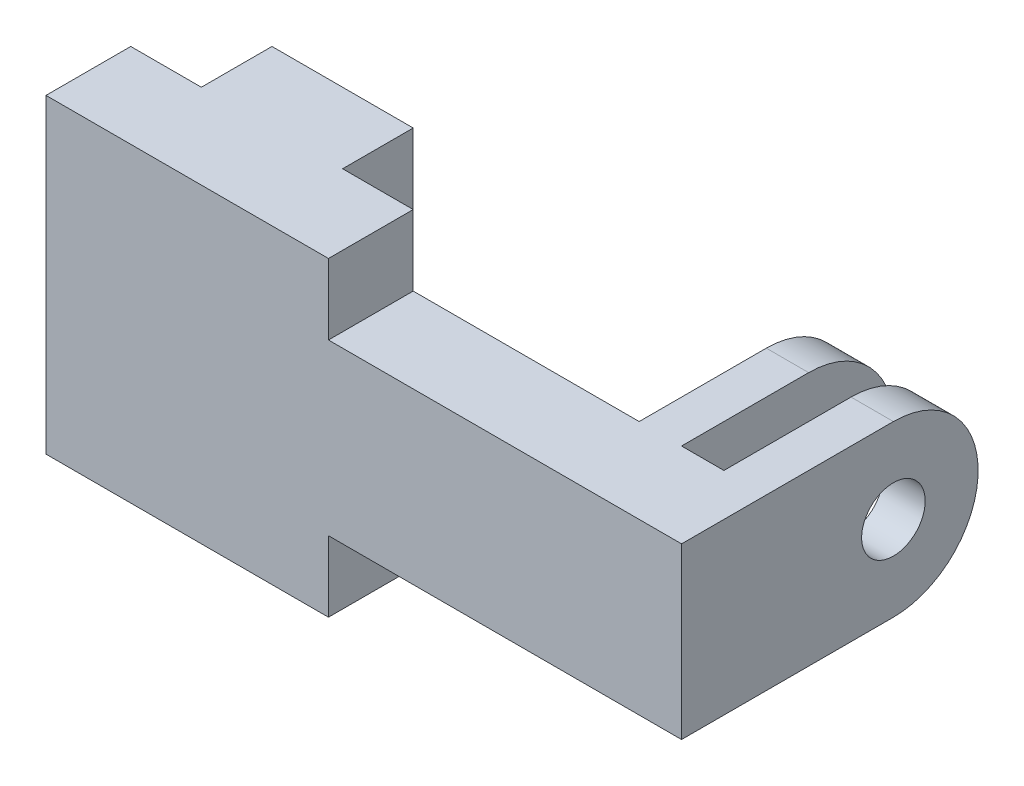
from build123d import *

# Parameters (mm, degrees)
BOSS_EXTRUDE1_DEPTH = 6
SKETCH2_W           = 3
SKETCH2_H           = 12
BOSS_EXTRUDE2_DEPTH = 15
SKETCH3_R           = 2.25
CUT_EXTRUDE1_DEPTH  = 49.692915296
SKETCH4_W           = 10
SKETCH4_H           = 22
BOSS_EXTRUDE3_DEPTH = 5
CUT_EXTRUDE2_REACH  = 46.113
SKETCH5_W           = 2
SKETCH5_H           = 15


with BuildPart() as part:
    # Sketch1 → Boss-Extrude1 (new body)
    with BuildSketch(Plane.XY):
        Polygon((-2.5, 6), (22.5, 6), (22.5, -6), (-2.5, -6), (-2.5, -11), (-22.5, -11), (-22.5, -6), (-22.5, 6), (-22.5, 11), (-2.5, 11), align=None)
    extrude(amount=BOSS_EXTRUDE1_DEPTH)

    # Sketch2 → Boss-Extrude2 (add)
    with BuildSketch(Plane(origin=(0, 0, 0), x_dir=(-1, 0, 0), z_dir=(0, 0, -1))):
        with Locations((-21, 0)):
            Rectangle(SKETCH2_W, SKETCH2_H)
        with Locations((-15, 0)):
            Rectangle(SKETCH2_W, SKETCH2_H)
    extrude(amount=BOSS_EXTRUDE2_DEPTH)

    # Sketch3 → Cut-Extrude1 (cut, through all)
    with BuildSketch(Plane(origin=(22.5, 0, 0), x_dir=(0, 0, -1), z_dir=(1, 0, 0))):
        with Locations((9, 0)):
            Circle(SKETCH3_R)
        with BuildLine():
            Line((15, 6), (9, 6))
            ThreePointArc((9, 6), (13.242640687, 4.242640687), (15, 0))
            Line((15, 0), (15, 6))
        make_face()
        with BuildLine():
            Line((15, -6), (15, 0))
            ThreePointArc((15, 0), (13.242640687, -4.242640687), (9, -6))
            Line((9, -6), (15, -6))
        make_face()
    extrude(amount=-CUT_EXTRUDE1_DEPTH, mode=Mode.SUBTRACT)

    # Sketch4 → Boss-Extrude3 (add)
    with BuildSketch(Plane(origin=(0, 0, 0), x_dir=(-1, 0, 0), z_dir=(0, 0, -1))):
        with Locations((12.5, 0)):
            Rectangle(SKETCH4_W, SKETCH4_H)
    extrude(amount=BOSS_EXTRUDE3_DEPTH)

    # Sketch5 → Cut-Extrude2 (cut, up to next)
    with BuildSketch(Plane.ZY.offset(17.5), mode=Mode.PRIVATE) as cut_extrude2_sk1:
        with Locations((-1, 0)):
            Rectangle(SKETCH5_W, SKETCH5_H)
    cut_extrude2_tool1 = extrude(cut_extrude2_sk1.sketch, amount=-CUT_EXTRUDE2_REACH, mode=Mode.PRIVATE) & part.part
    add(cut_extrude2_tool1.solids().sort_by_distance((-17.5, 0, -1))[0], mode=Mode.SUBTRACT)


solid = part.part
